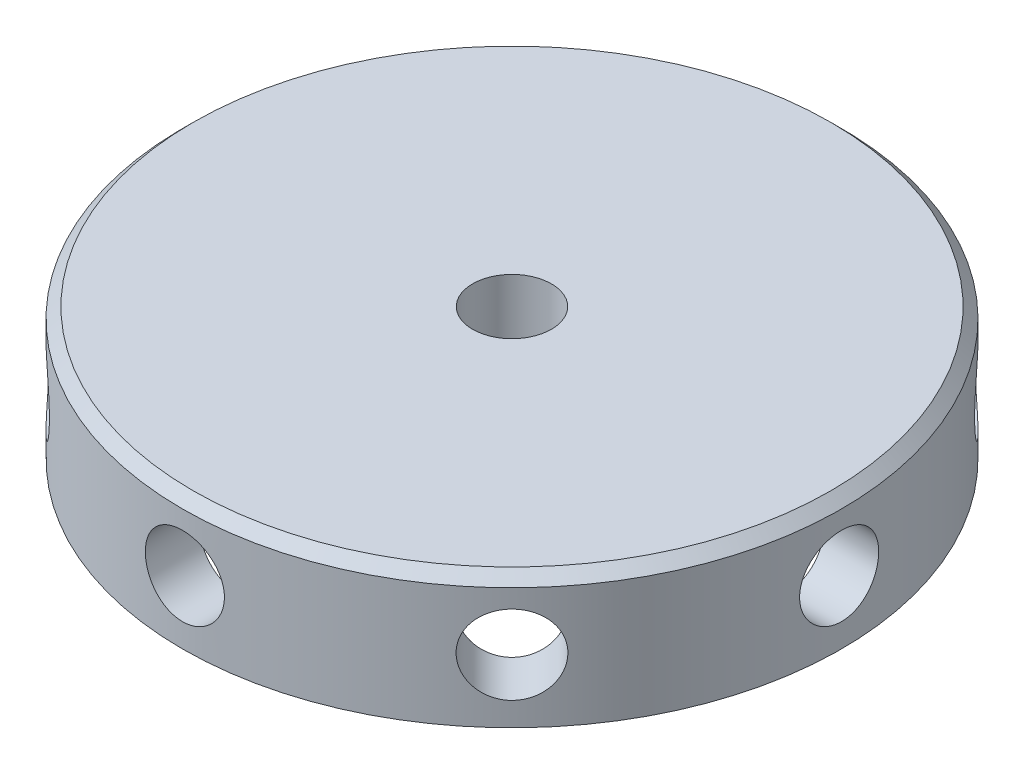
from build123d import *

# Parameters (mm, degrees)
SKETCH2_R                 = 15.875
BOSS_EXTRUDE2_DEPTH       = 6.35
CHAMFER1_SIZE             = 0.508
SKETCH3_R                 = 13.335
SKETCH3_R_2               = 3.81
CUT_EXTRUDE1_DEPTH        = 5.08
F_6_CLEARANCE_HOLE1_D     = 3.7973
F_6_CLEARANCE_HOLE1_DEPTH = 9.398
F_6_CLEARANCE_HOLE1_TIP   = 1.140824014
SKETCH6_R                 = 1.905
CUT_EXTRUDE3_DEPTH        = 3.81
CIRPATTERN1_COUNT         = 8


with BuildPart() as part:
    # Sketch2 → Boss-Extrude2 (new body)
    with BuildSketch(Plane(origin=(0, 0, 0), x_dir=(1, 0, 0), z_dir=(0, 1, 0))):
        with Locations(Location((0, 0, 0), (0, 0, 270))):
            Circle(SKETCH2_R)
    extrude(amount=BOSS_EXTRUDE2_DEPTH)

    # Chamfer1
    chamfer1_edges = [part.edges().sort_by_distance(p)[0] for p in [
        (0, 6.35, -15.875),
    ]]
    chamfer(chamfer1_edges, length=CHAMFER1_SIZE)

    # Sketch3 → Cut-Extrude1 (cut)
    with BuildSketch(Plane.XZ):
        with Locations(Location((0, 0, 0), (0, 0, 270))):
            Circle(SKETCH3_R)
        with Locations(Location((0, 0, 0), (0, 0, 270))):
            Circle(SKETCH3_R_2, mode=Mode.SUBTRACT)
    extrude(amount=-CUT_EXTRUDE1_DEPTH, mode=Mode.SUBTRACT)

    # 6 Clearance Hole1
    with Locations(Plane(origin=(0, 6.35, 0), x_dir=(1, 0, 0), z_dir=(0, 1, 0))):
        with Locations((0, 0)):
            Hole(F_6_CLEARANCE_HOLE1_D / 2, depth=F_6_CLEARANCE_HOLE1_DEPTH)
            with Locations((0, 0, -(F_6_CLEARANCE_HOLE1_DEPTH + F_6_CLEARANCE_HOLE1_TIP / 2))):  # 118° drill point
                Cone(0, F_6_CLEARANCE_HOLE1_D / 2, F_6_CLEARANCE_HOLE1_TIP, mode=Mode.SUBTRACT)

    # Sketch6 → Cut-Extrude3 (cut)
    with BuildSketch(Plane.XY.offset(15.875)):
        with Locations((0, 3.048)):
            Circle(SKETCH6_R)
    cut_extrude3 = extrude(amount=-CUT_EXTRUDE3_DEPTH, mode=Mode.SUBTRACT)

    # CirPattern1: Cut-Extrude3 ×8 about axis
    cirpattern1_axis = Axis((0, 0, 0), (0, 1, 0))
    for i in range(1, CIRPATTERN1_COUNT):
        add(cut_extrude3.rotate(cirpattern1_axis, i * 360 / CIRPATTERN1_COUNT), mode=Mode.SUBTRACT)


solid = part.part
